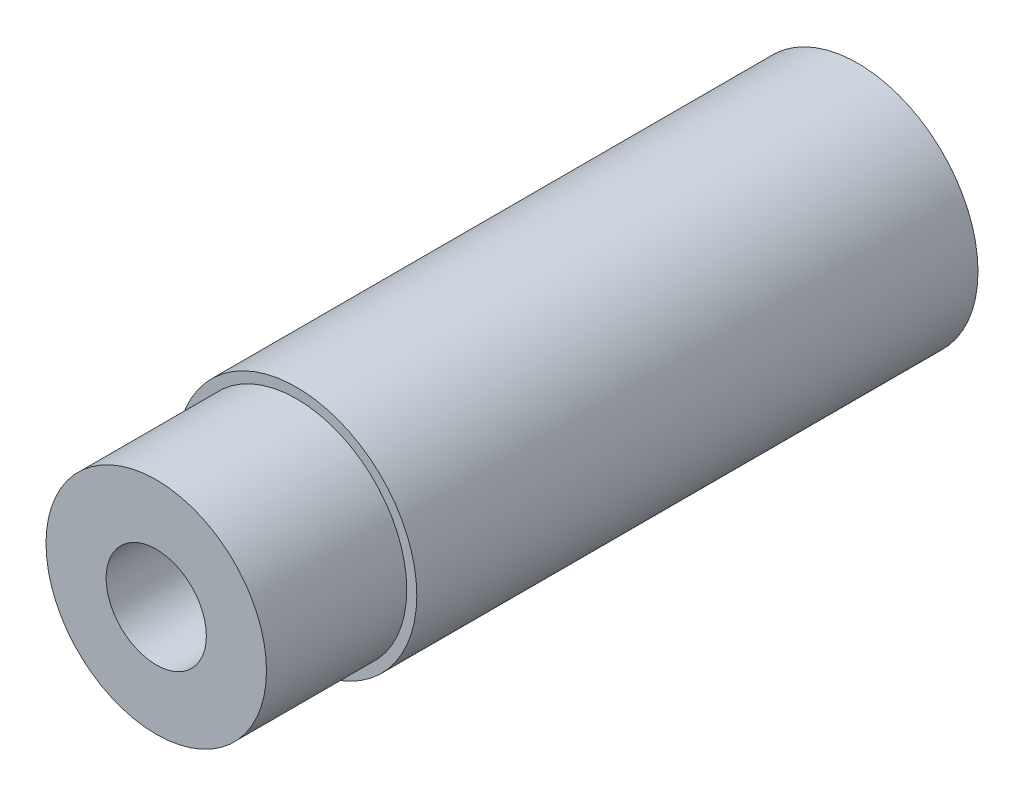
from build123d import *

# Parameters (mm, degrees)
SKICA1_R                 = 3
VYSUNOUT1_DEPTH          = 14
SKICA2_R                 = 2.75
VYSUNOUT2_DEPTH          = 3.5
SKICA3_R                 = 1.25
ODEBRAT_VYSUNUT_M1_DEPTH = 3


with BuildPart() as part:
    # Skica1 → Vysunout1 (new body)
    with BuildSketch(Plane.XY.offset(-21.994490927)):
        with Locations((-10, 0)):
            Circle(SKICA1_R)
    extrude(amount=VYSUNOUT1_DEPTH)

    # Skica2 → Vysunout2 (add)
    with BuildSketch(Plane.XY.offset(-7.994490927)):
        with Locations((-10, 0)):
            Circle(SKICA2_R)
    extrude(amount=VYSUNOUT2_DEPTH)

    # Skica3 → Odebrat vysunut_m1 (cut)
    with BuildSketch(Plane.XY.offset(-4.494490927)):
        with Locations((-10, 0)):
            Circle(SKICA3_R)
    extrude(amount=-ODEBRAT_VYSUNUT_M1_DEPTH, mode=Mode.SUBTRACT)


solid = part.part
